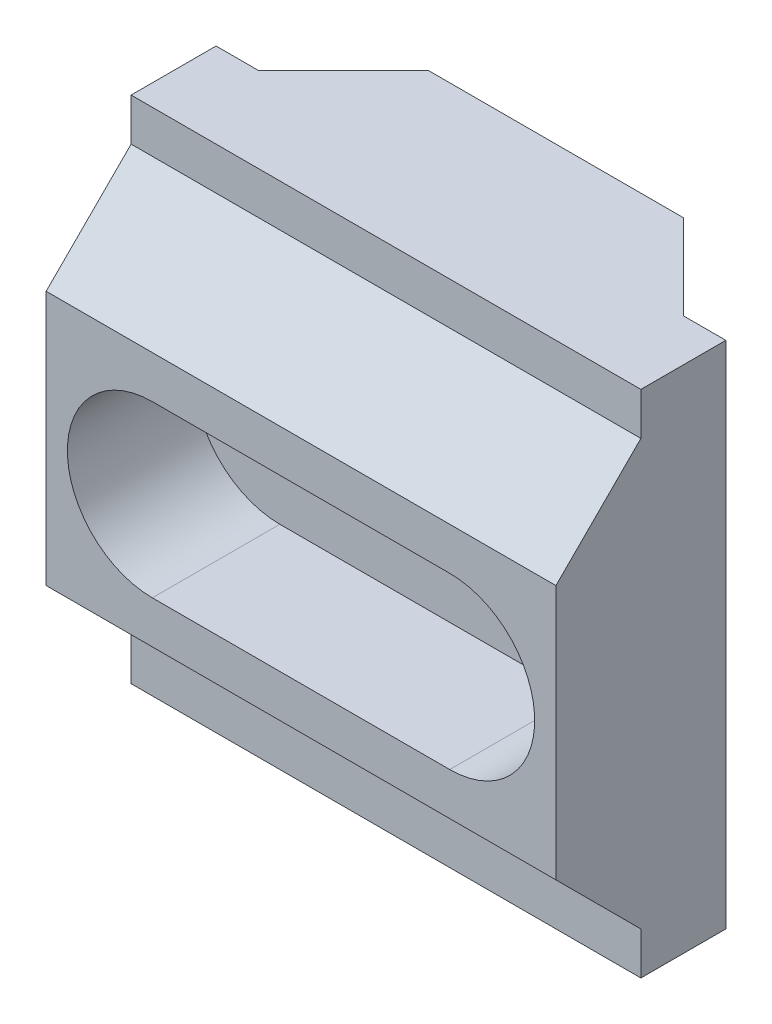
ISO-10303-21;
HEADER;
FILE_DESCRIPTION(('STEP AP214'),'2;1');
FILE_NAME('part.step','',(''),(''),'','','');
FILE_SCHEMA(('AUTOMOTIVE_DESIGN { 1 0 10303 214 1 1 1 1 }'));
ENDSEC;
DATA;
#1=APPLICATION_CONTEXT('core data for automotive mechanical design processes');
#2=APPLICATION_PROTOCOL_DEFINITION('international standard','automotive_design',2000,#1);
#3=PRODUCT_CONTEXT('',#1,'mechanical');
#4=PRODUCT('Part','Part','',(#3));
#5=PRODUCT_RELATED_PRODUCT_CATEGORY('part','',(#4));
#6=PRODUCT_DEFINITION_FORMATION('','',#4);
#7=PRODUCT_DEFINITION_CONTEXT('part definition',#1,'design');
#8=PRODUCT_DEFINITION('design','',#6,#7);
#9=PRODUCT_DEFINITION_SHAPE('','',#8);
#10=(LENGTH_UNIT() NAMED_UNIT(*) SI_UNIT(.MILLI.,.METRE.));
#11=(NAMED_UNIT(*) PLANE_ANGLE_UNIT() SI_UNIT($,.RADIAN.));
#12=(NAMED_UNIT(*) SI_UNIT($,.STERADIAN.) SOLID_ANGLE_UNIT());
#13=UNCERTAINTY_MEASURE_WITH_UNIT(LENGTH_MEASURE(1.E-05),#10,'distance_accuracy_value','');
#14=(GEOMETRIC_REPRESENTATION_CONTEXT(3) GLOBAL_UNCERTAINTY_ASSIGNED_CONTEXT((#13)) GLOBAL_UNIT_ASSIGNED_CONTEXT((#10,
#11,#12)) REPRESENTATION_CONTEXT('',''));
#15=CARTESIAN_POINT('',(0.,0.,0.));
#16=DIRECTION('',(0.,0.,1.));
#17=DIRECTION('',(1.,0.,0.));
#18=AXIS2_PLACEMENT_3D('',#15,#16,#17);
#19=CARTESIAN_POINT('',(0.,0.,-7.21911419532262E-13));
#20=DIRECTION('',(0.,0.,-1.));
#21=DIRECTION('',(-1.,0.,0.));
#22=AXIS2_PLACEMENT_3D('',#19,#20,#21);
#23=PLANE('',#22);
#24=DIRECTION('',(1.,0.,0.));
#25=VECTOR('',#24,1.);
#26=CARTESIAN_POINT('',(22.225,-12.7,-7.21911419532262E-13));
#27=LINE('',#26,#25);
#28=CARTESIAN_POINT('',(-22.225,-12.7,-7.21911419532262E-13));
#29=VERTEX_POINT('',#28);
#30=CARTESIAN_POINT('',(22.225,-12.7,-7.21911419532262E-13));
#31=VERTEX_POINT('',#30);
#32=EDGE_CURVE('E150',#29,#31,#27,.T.);
#33=ORIENTED_EDGE('',*,*,#32,.T.);
#34=CARTESIAN_POINT('',(22.225,0.,-7.21911419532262E-13));
#35=DIRECTION('',(0.,0.,1.));
#36=DIRECTION('',(1.,0.,0.));
#37=AXIS2_PLACEMENT_3D('',#34,#35,#36);
#38=CIRCLE('',#37,12.7);
#39=CARTESIAN_POINT('',(22.225,12.7,-7.21911419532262E-13));
#40=VERTEX_POINT('',#39);
#41=EDGE_CURVE('E19',#31,#40,#38,.T.);
#42=ORIENTED_EDGE('',*,*,#41,.T.);
#43=DIRECTION('',(1.,0.,0.));
#44=VECTOR('',#43,1.);
#45=CARTESIAN_POINT('',(-22.225,12.7,-7.21911419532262E-13));
#46=LINE('',#45,#44);
#47=CARTESIAN_POINT('',(-22.225,12.7,-7.21911419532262E-13));
#48=VERTEX_POINT('',#47);
#49=EDGE_CURVE('E153',#40,#48,#46,.F.);
#50=ORIENTED_EDGE('',*,*,#49,.T.);
#51=CARTESIAN_POINT('',(-22.225,0.,-7.21911419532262E-13));
#52=DIRECTION('',(0.,0.,1.));
#53=DIRECTION('',(1.,0.,0.));
#54=AXIS2_PLACEMENT_3D('',#51,#52,#53);
#55=CIRCLE('',#54,12.7);
#56=EDGE_CURVE('E208',#48,#29,#55,.T.);
#57=ORIENTED_EDGE('',*,*,#56,.T.);
#58=EDGE_LOOP('',(#33,#42,#50,#57));
#59=FACE_BOUND('',#58,.T.);
#60=ADVANCED_FACE('F16',(#59),#23,.F.);
#61=CARTESIAN_POINT('',(-22.225,12.7,-7.21911419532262E-13));
#62=DIRECTION('',(0.,1.,0.));
#63=DIRECTION('',(0.,0.,1.));
#64=AXIS2_PLACEMENT_3D('',#61,#62,#63);
#65=PLANE('',#64);
#66=DIRECTION('',(0.,0.,1.));
#67=VECTOR('',#66,1.);
#68=CARTESIAN_POINT('',(-22.225,12.7,-7.21911419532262E-13));
#69=LINE('',#68,#67);
#70=CARTESIAN_POINT('',(-22.225,12.7,19.05));
#71=VERTEX_POINT('',#70);
#72=EDGE_CURVE('E163',#71,#48,#69,.F.);
#73=ORIENTED_EDGE('',*,*,#72,.T.);
#74=ORIENTED_EDGE('',*,*,#49,.F.);
#75=DIRECTION('',(0.,0.,1.));
#76=VECTOR('',#75,1.);
#77=CARTESIAN_POINT('',(22.225,12.7,-7.21911419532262E-13));
#78=LINE('',#77,#76);
#79=CARTESIAN_POINT('',(22.225,12.7,19.05));
#80=VERTEX_POINT('',#79);
#81=EDGE_CURVE('E158',#40,#80,#78,.T.);
#82=ORIENTED_EDGE('',*,*,#81,.T.);
#83=DIRECTION('',(1.,0.,0.));
#84=VECTOR('',#83,1.);
#85=CARTESIAN_POINT('',(38.1,12.7,19.05));
#86=LINE('',#85,#84);
#87=EDGE_CURVE('E207',#71,#80,#86,.T.);
#88=ORIENTED_EDGE('',*,*,#87,.F.);
#89=EDGE_LOOP('',(#73,#74,#82,#88));
#90=FACE_BOUND('',#89,.T.);
#91=ADVANCED_FACE('F160',(#90),#65,.F.);
#92=CARTESIAN_POINT('',(22.225,0.,-7.21911419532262E-13));
#93=DIRECTION('',(0.,0.,1.));
#94=DIRECTION('',(1.,0.,0.));
#95=AXIS2_PLACEMENT_3D('',#92,#93,#94);
#96=CYLINDRICAL_SURFACE('',#95,12.7);
#97=ORIENTED_EDGE('',*,*,#81,.F.);
#98=ORIENTED_EDGE('',*,*,#41,.F.);
#99=DIRECTION('',(0.,0.,1.));
#100=VECTOR('',#99,1.);
#101=CARTESIAN_POINT('',(22.225,-12.7,-7.21911419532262E-13));
#102=LINE('',#101,#100);
#103=CARTESIAN_POINT('',(22.225,-12.7,19.05));
#104=VERTEX_POINT('',#103);
#105=EDGE_CURVE('E171',#31,#104,#102,.T.);
#106=ORIENTED_EDGE('',*,*,#105,.T.);
#107=CARTESIAN_POINT('',(22.225,0.,19.05));
#108=DIRECTION('',(0.,0.,1.));
#109=DIRECTION('',(1.,0.,0.));
#110=AXIS2_PLACEMENT_3D('',#107,#108,#109);
#111=CIRCLE('',#110,12.7);
#112=EDGE_CURVE('E168',#80,#104,#111,.F.);
#113=ORIENTED_EDGE('',*,*,#112,.F.);
#114=EDGE_LOOP('',(#97,#98,#106,#113));
#115=FACE_BOUND('',#114,.T.);
#116=ADVANCED_FACE('F166',(#115),#96,.F.);
#117=CARTESIAN_POINT('',(22.225,-12.7,-7.21911419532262E-13));
#118=DIRECTION('',(0.,-1.,0.));
#119=DIRECTION('',(1.,0.,0.));
#120=AXIS2_PLACEMENT_3D('',#117,#118,#119);
#121=PLANE('',#120);
#122=ORIENTED_EDGE('',*,*,#105,.F.);
#123=ORIENTED_EDGE('',*,*,#32,.F.);
#124=DIRECTION('',(0.,0.,1.));
#125=VECTOR('',#124,1.);
#126=CARTESIAN_POINT('',(-22.225,-12.7,-7.21911419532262E-13));
#127=LINE('',#126,#125);
#128=CARTESIAN_POINT('',(-22.225,-12.7,19.05));
#129=VERTEX_POINT('',#128);
#130=EDGE_CURVE('E209',#29,#129,#127,.T.);
#131=ORIENTED_EDGE('',*,*,#130,.T.);
#132=DIRECTION('',(1.,0.,0.));
#133=VECTOR('',#132,1.);
#134=CARTESIAN_POINT('',(38.1,-12.7,19.05));
#135=LINE('',#134,#133);
#136=EDGE_CURVE('E206',#104,#129,#135,.F.);
#137=ORIENTED_EDGE('',*,*,#136,.F.);
#138=EDGE_LOOP('',(#122,#123,#131,#137));
#139=FACE_BOUND('',#138,.T.);
#140=ADVANCED_FACE('F425',(#139),#121,.F.);
#141=CARTESIAN_POINT('',(-22.225,0.,-7.21911419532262E-13));
#142=DIRECTION('',(0.,0.,1.));
#143=DIRECTION('',(1.,0.,0.));
#144=AXIS2_PLACEMENT_3D('',#141,#142,#143);
#145=CYLINDRICAL_SURFACE('',#144,12.7);
#146=ORIENTED_EDGE('',*,*,#130,.F.);
#147=ORIENTED_EDGE('',*,*,#56,.F.);
#148=ORIENTED_EDGE('',*,*,#72,.F.);
#149=CARTESIAN_POINT('',(-22.225,0.,19.05));
#150=DIRECTION('',(0.,0.,1.));
#151=DIRECTION('',(1.,0.,0.));
#152=AXIS2_PLACEMENT_3D('',#149,#150,#151);
#153=CIRCLE('',#152,12.7);
#154=EDGE_CURVE('E202',#129,#71,#153,.F.);
#155=ORIENTED_EDGE('',*,*,#154,.F.);
#156=EDGE_LOOP('',(#146,#147,#148,#155));
#157=FACE_BOUND('',#156,.T.);
#158=ADVANCED_FACE('F417',(#157),#145,.F.);
#159=CARTESIAN_POINT('',(-17.4625,-25.4,-4.76250000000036));
#160=DIRECTION('',(0.,1.,0.));
#161=DIRECTION('',(0.,0.,1.));
#162=AXIS2_PLACEMENT_3D('',#159,#160,#161);
#163=PLANE('',#162);
#164=CARTESIAN_POINT('',(-17.4625,-25.4,-4.76250000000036));
#165=DIRECTION('',(0.,-1.,0.));
#166=DIRECTION('',(1.,0.,0.));
#167=AXIS2_PLACEMENT_3D('',#164,#165,#166);
#168=CIRCLE('',#167,2.5796875);
#169=CARTESIAN_POINT('',(-14.8828125,-25.4,-4.76250000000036));
#170=VERTEX_POINT('',#169);
#171=CARTESIAN_POINT('',(-20.0421875,-25.4,-4.76250000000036));
#172=VERTEX_POINT('',#171);
#173=EDGE_CURVE('E196',#170,#172,#168,.T.);
#174=ORIENTED_EDGE('',*,*,#173,.T.);
#175=CARTESIAN_POINT('',(-17.4625,-25.4,-4.76250000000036));
#176=DIRECTION('',(0.,-1.,0.));
#177=DIRECTION('',(1.,0.,0.));
#178=AXIS2_PLACEMENT_3D('',#175,#176,#177);
#179=CIRCLE('',#178,2.5796875);
#180=EDGE_CURVE('E199',#172,#170,#179,.T.);
#181=ORIENTED_EDGE('',*,*,#180,.T.);
#182=EDGE_LOOP('',(#174,#181));
#183=FACE_BOUND('',#182,.T.);
#184=ADVANCED_FACE('F414',(#183),#163,.F.);
#185=CARTESIAN_POINT('',(17.4625,-25.4,-4.76250000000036));
#186=DIRECTION('',(0.,1.,0.));
#187=DIRECTION('',(0.,0.,1.));
#188=AXIS2_PLACEMENT_3D('',#185,#186,#187);
#189=PLANE('',#188);
#190=CARTESIAN_POINT('',(17.4625,-25.4,-4.76250000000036));
#191=DIRECTION('',(0.,-1.,0.));
#192=DIRECTION('',(1.,0.,0.));
#193=AXIS2_PLACEMENT_3D('',#190,#191,#192);
#194=CIRCLE('',#193,2.5796875);
#195=CARTESIAN_POINT('',(20.0421875,-25.4,-4.76250000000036));
#196=VERTEX_POINT('',#195);
#197=CARTESIAN_POINT('',(14.8828125,-25.4,-4.76250000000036));
#198=VERTEX_POINT('',#197);
#199=EDGE_CURVE('E190',#196,#198,#194,.T.);
#200=ORIENTED_EDGE('',*,*,#199,.T.);
#201=CARTESIAN_POINT('',(17.4625,-25.4,-4.76250000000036));
#202=DIRECTION('',(0.,-1.,0.));
#203=DIRECTION('',(1.,0.,0.));
#204=AXIS2_PLACEMENT_3D('',#201,#202,#203);
#205=CIRCLE('',#204,2.5796875);
#206=EDGE_CURVE('E193',#198,#196,#205,.T.);
#207=ORIENTED_EDGE('',*,*,#206,.T.);
#208=EDGE_LOOP('',(#200,#207));
#209=FACE_BOUND('',#208,.T.);
#210=ADVANCED_FACE('F416',(#209),#189,.F.);
#211=CARTESIAN_POINT('',(38.1,-19.05,19.05));
#212=DIRECTION('',(0.,-0.707106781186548,0.707106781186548));
#213=DIRECTION('',(0.,-0.707106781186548,-0.707106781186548));
#214=AXIS2_PLACEMENT_3D('',#211,#212,#213);
#215=PLANE('',#214);
#216=DIRECTION('',(0.,0.707106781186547,0.707106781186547));
#217=VECTOR('',#216,1.);
#218=CARTESIAN_POINT('',(38.1,-31.75,6.35));
#219=LINE('',#218,#217);
#220=CARTESIAN_POINT('',(38.1,-31.75,6.35000000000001));
#221=VERTEX_POINT('',#220);
#222=CARTESIAN_POINT('',(38.1,-19.05,19.05));
#223=VERTEX_POINT('',#222);
#224=EDGE_CURVE('E231',#221,#223,#219,.T.);
#225=ORIENTED_EDGE('',*,*,#224,.T.);
#226=DIRECTION('',(1.,0.,0.));
#227=VECTOR('',#226,1.);
#228=CARTESIAN_POINT('',(38.1,-19.05,19.05));
#229=LINE('',#228,#227);
#230=CARTESIAN_POINT('',(-38.1,-19.05,19.05));
#231=VERTEX_POINT('',#230);
#232=EDGE_CURVE('E205',#231,#223,#229,.T.);
#233=ORIENTED_EDGE('',*,*,#232,.F.);
#234=DIRECTION('',(0.,0.707106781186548,0.707106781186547));
#235=VECTOR('',#234,1.);
#236=CARTESIAN_POINT('',(-38.1,-31.75,6.35));
#237=LINE('',#236,#235);
#238=CARTESIAN_POINT('',(-38.1,-31.75,6.35000000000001));
#239=VERTEX_POINT('',#238);
#240=EDGE_CURVE('E249',#239,#231,#237,.T.);
#241=ORIENTED_EDGE('',*,*,#240,.F.);
#242=DIRECTION('',(1.,0.,0.));
#243=VECTOR('',#242,1.);
#244=CARTESIAN_POINT('',(38.1,-31.75,6.35));
#245=LINE('',#244,#243);
#246=EDGE_CURVE('E225',#221,#239,#245,.F.);
#247=ORIENTED_EDGE('',*,*,#246,.F.);
#248=EDGE_LOOP('',(#225,#233,#241,#247));
#249=FACE_BOUND('',#248,.T.);
#250=ADVANCED_FACE('F351',(#249),#215,.T.);
#251=CARTESIAN_POINT('',(38.1,19.05,19.05));
#252=DIRECTION('',(0.,0.,1.));
#253=DIRECTION('',(1.,0.,0.));
#254=AXIS2_PLACEMENT_3D('',#251,#252,#253);
#255=PLANE('',#254);
#256=DIRECTION('',(0.,-1.,0.));
#257=VECTOR('',#256,1.);
#258=CARTESIAN_POINT('',(38.1,0.,19.05));
#259=LINE('',#258,#257);
#260=CARTESIAN_POINT('',(38.1,19.05,19.05));
#261=VERTEX_POINT('',#260);
#262=EDGE_CURVE('E233',#223,#261,#259,.F.);
#263=ORIENTED_EDGE('',*,*,#262,.T.);
#264=DIRECTION('',(1.,0.,0.));
#265=VECTOR('',#264,1.);
#266=CARTESIAN_POINT('',(38.1,19.05,19.05));
#267=LINE('',#266,#265);
#268=CARTESIAN_POINT('',(-38.1,19.05,19.05));
#269=VERTEX_POINT('',#268);
#270=EDGE_CURVE('E201',#269,#261,#267,.T.);
#271=ORIENTED_EDGE('',*,*,#270,.F.);
#272=DIRECTION('',(0.,-1.,0.));
#273=VECTOR('',#272,1.);
#274=CARTESIAN_POINT('',(-38.1,38.1,19.05));
#275=LINE('',#274,#273);
#276=EDGE_CURVE('E252',#231,#269,#275,.F.);
#277=ORIENTED_EDGE('',*,*,#276,.F.);
#278=ORIENTED_EDGE('',*,*,#232,.T.);
#279=EDGE_LOOP('',(#263,#271,#277,#278));
#280=FACE_BOUND('',#279,.T.);
#281=ORIENTED_EDGE('',*,*,#136,.T.);
#282=ORIENTED_EDGE('',*,*,#154,.T.);
#283=ORIENTED_EDGE('',*,*,#87,.T.);
#284=ORIENTED_EDGE('',*,*,#112,.T.);
#285=EDGE_LOOP('',(#281,#282,#283,#284));
#286=FACE_BOUND('',#285,.T.);
#287=ADVANCED_FACE('F353',(#280,#286),#255,.T.);
#288=CARTESIAN_POINT('',(38.1,31.75,6.35));
#289=DIRECTION('',(0.,0.707106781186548,0.707106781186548));
#290=DIRECTION('',(0.,-0.707106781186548,0.707106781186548));
#291=AXIS2_PLACEMENT_3D('',#288,#289,#290);
#292=PLANE('',#291);
#293=DIRECTION('',(0.,0.707106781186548,-0.707106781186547));
#294=VECTOR('',#293,1.);
#295=CARTESIAN_POINT('',(38.1,19.05,19.05));
#296=LINE('',#295,#294);
#297=CARTESIAN_POINT('',(38.1,31.75,6.35));
#298=VERTEX_POINT('',#297);
#299=EDGE_CURVE('E235',#261,#298,#296,.T.);
#300=ORIENTED_EDGE('',*,*,#299,.T.);
#301=DIRECTION('',(1.,0.,0.));
#302=VECTOR('',#301,1.);
#303=CARTESIAN_POINT('',(38.1,31.75,6.35));
#304=LINE('',#303,#302);
#305=CARTESIAN_POINT('',(-38.1,31.75,6.35000000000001));
#306=VERTEX_POINT('',#305);
#307=EDGE_CURVE('E237',#306,#298,#304,.T.);
#308=ORIENTED_EDGE('',*,*,#307,.F.);
#309=DIRECTION('',(0.,0.707106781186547,-0.707106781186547));
#310=VECTOR('',#309,1.);
#311=CARTESIAN_POINT('',(-38.1,19.05,19.05));
#312=LINE('',#311,#310);
#313=EDGE_CURVE('E255',#269,#306,#312,.T.);
#314=ORIENTED_EDGE('',*,*,#313,.F.);
#315=ORIENTED_EDGE('',*,*,#270,.T.);
#316=EDGE_LOOP('',(#300,#308,#314,#315));
#317=FACE_BOUND('',#316,.T.);
#318=ADVANCED_FACE('F357',(#317),#292,.T.);
#319=CARTESIAN_POINT('',(-17.4625,-31.75,-4.76250000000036));
#320=DIRECTION('',(0.,-1.,0.));
#321=DIRECTION('',(1.,0.,0.));
#322=AXIS2_PLACEMENT_3D('',#319,#320,#321);
#323=CYLINDRICAL_SURFACE('',#322,2.5796875);
#324=ORIENTED_EDGE('',*,*,#180,.F.);
#325=DIRECTION('',(0.,-1.,0.));
#326=VECTOR('',#325,1.);
#327=CARTESIAN_POINT('',(-20.0421875,-31.75,-4.76250000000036));
#328=LINE('',#327,#326);
#329=CARTESIAN_POINT('',(-20.0421875,-38.1,-4.76250000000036));
#330=VERTEX_POINT('',#329);
#331=EDGE_CURVE('E198',#172,#330,#328,.T.);
#332=ORIENTED_EDGE('',*,*,#331,.T.);
#333=CARTESIAN_POINT('',(-17.4625,-38.1,-4.76250000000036));
#334=DIRECTION('',(0.,-1.,0.));
#335=DIRECTION('',(1.,0.,0.));
#336=AXIS2_PLACEMENT_3D('',#333,#334,#335);
#337=CIRCLE('',#336,2.5796875);
#338=CARTESIAN_POINT('',(-14.8828125,-38.1,-4.76250000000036));
#339=VERTEX_POINT('',#338);
#340=EDGE_CURVE('E186',#339,#330,#337,.F.);
#341=ORIENTED_EDGE('',*,*,#340,.F.);
#342=DIRECTION('',(0.,-1.,0.));
#343=VECTOR('',#342,1.);
#344=CARTESIAN_POINT('',(-14.8828125,-31.75,-4.76250000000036));
#345=LINE('',#344,#343);
#346=EDGE_CURVE('E195',#339,#170,#345,.F.);
#347=ORIENTED_EDGE('',*,*,#346,.T.);
#348=EDGE_LOOP('',(#324,#332,#341,#347));
#349=FACE_BOUND('',#348,.T.);
#350=ADVANCED_FACE('F359',(#349),#323,.F.);
#351=CARTESIAN_POINT('',(-17.4625,-31.75,-4.76250000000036));
#352=DIRECTION('',(0.,-1.,0.));
#353=DIRECTION('',(1.,0.,0.));
#354=AXIS2_PLACEMENT_3D('',#351,#352,#353);
#355=CYLINDRICAL_SURFACE('',#354,2.5796875);
#356=CARTESIAN_POINT('',(-17.4625,-38.1,-4.76250000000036));
#357=DIRECTION('',(0.,-1.,0.));
#358=DIRECTION('',(1.,0.,0.));
#359=AXIS2_PLACEMENT_3D('',#356,#357,#358);
#360=CIRCLE('',#359,2.5796875);
#361=EDGE_CURVE('E183',#330,#339,#360,.F.);
#362=ORIENTED_EDGE('',*,*,#361,.F.);
#363=ORIENTED_EDGE('',*,*,#331,.F.);
#364=ORIENTED_EDGE('',*,*,#173,.F.);
#365=ORIENTED_EDGE('',*,*,#346,.F.);
#366=EDGE_LOOP('',(#362,#363,#364,#365));
#367=FACE_BOUND('',#366,.T.);
#368=ADVANCED_FACE('F366',(#367),#355,.F.);
#369=CARTESIAN_POINT('',(17.4625,-31.75,-4.76250000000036));
#370=DIRECTION('',(0.,-1.,0.));
#371=DIRECTION('',(1.,0.,0.));
#372=AXIS2_PLACEMENT_3D('',#369,#370,#371);
#373=CYLINDRICAL_SURFACE('',#372,2.5796875);
#374=ORIENTED_EDGE('',*,*,#206,.F.);
#375=DIRECTION('',(0.,-1.,0.));
#376=VECTOR('',#375,1.);
#377=CARTESIAN_POINT('',(14.8828125,-31.75,-4.76250000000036));
#378=LINE('',#377,#376);
#379=CARTESIAN_POINT('',(14.8828125,-38.1,-4.76250000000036));
#380=VERTEX_POINT('',#379);
#381=EDGE_CURVE('E192',#198,#380,#378,.T.);
#382=ORIENTED_EDGE('',*,*,#381,.T.);
#383=CARTESIAN_POINT('',(17.4625,-38.1,-4.76250000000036));
#384=DIRECTION('',(0.,-1.,0.));
#385=DIRECTION('',(1.,0.,0.));
#386=AXIS2_PLACEMENT_3D('',#383,#384,#385);
#387=CIRCLE('',#386,2.5796875);
#388=CARTESIAN_POINT('',(20.0421875,-38.1,-4.76250000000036));
#389=VERTEX_POINT('',#388);
#390=EDGE_CURVE('E180',#389,#380,#387,.F.);
#391=ORIENTED_EDGE('',*,*,#390,.F.);
#392=DIRECTION('',(0.,-1.,0.));
#393=VECTOR('',#392,1.);
#394=CARTESIAN_POINT('',(20.0421875,-31.75,-4.76250000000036));
#395=LINE('',#394,#393);
#396=EDGE_CURVE('E222',#389,#196,#395,.F.);
#397=ORIENTED_EDGE('',*,*,#396,.T.);
#398=EDGE_LOOP('',(#374,#382,#391,#397));
#399=FACE_BOUND('',#398,.T.);
#400=ADVANCED_FACE('F398',(#399),#373,.F.);
#401=CARTESIAN_POINT('',(17.4625,-31.75,-4.76250000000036));
#402=DIRECTION('',(0.,-1.,0.));
#403=DIRECTION('',(1.,0.,0.));
#404=AXIS2_PLACEMENT_3D('',#401,#402,#403);
#405=CYLINDRICAL_SURFACE('',#404,2.5796875);
#406=CARTESIAN_POINT('',(17.4625,-38.1,-4.76250000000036));
#407=DIRECTION('',(0.,-1.,0.));
#408=DIRECTION('',(1.,0.,0.));
#409=AXIS2_PLACEMENT_3D('',#406,#407,#408);
#410=CIRCLE('',#409,2.5796875);
#411=EDGE_CURVE('E176',#380,#389,#410,.F.);
#412=ORIENTED_EDGE('',*,*,#411,.F.);
#413=ORIENTED_EDGE('',*,*,#381,.F.);
#414=ORIENTED_EDGE('',*,*,#199,.F.);
#415=ORIENTED_EDGE('',*,*,#396,.F.);
#416=EDGE_LOOP('',(#412,#413,#414,#415));
#417=FACE_BOUND('',#416,.T.);
#418=ADVANCED_FACE('F395',(#417),#405,.F.);
#419=CARTESIAN_POINT('',(38.1,-31.75,6.35));
#420=DIRECTION('',(0.,0.,1.));
#421=DIRECTION('',(1.,0.,0.));
#422=AXIS2_PLACEMENT_3D('',#419,#420,#421);
#423=PLANE('',#422);
#424=DIRECTION('',(0.,-1.,0.));
#425=VECTOR('',#424,1.);
#426=CARTESIAN_POINT('',(38.1,0.,6.35));
#427=LINE('',#426,#425);
#428=CARTESIAN_POINT('',(38.1,-38.1,6.35));
#429=VERTEX_POINT('',#428);
#430=EDGE_CURVE('E228',#429,#221,#427,.F.);
#431=ORIENTED_EDGE('',*,*,#430,.T.);
#432=ORIENTED_EDGE('',*,*,#246,.T.);
#433=DIRECTION('',(0.,-1.,0.));
#434=VECTOR('',#433,1.);
#435=CARTESIAN_POINT('',(-38.1,38.1,6.35));
#436=LINE('',#435,#434);
#437=CARTESIAN_POINT('',(-38.1,-38.1,6.35));
#438=VERTEX_POINT('',#437);
#439=EDGE_CURVE('E246',#438,#239,#436,.F.);
#440=ORIENTED_EDGE('',*,*,#439,.F.);
#441=DIRECTION('',(1.,0.,0.));
#442=VECTOR('',#441,1.);
#443=CARTESIAN_POINT('',(31.75,-38.1,6.35));
#444=LINE('',#443,#442);
#445=EDGE_CURVE('E267',#429,#438,#444,.F.);
#446=ORIENTED_EDGE('',*,*,#445,.F.);
#447=EDGE_LOOP('',(#431,#432,#440,#446));
#448=FACE_BOUND('',#447,.T.);
#449=ADVANCED_FACE('F346',(#448),#423,.T.);
#450=CARTESIAN_POINT('',(38.1,0.,6.35));
#451=DIRECTION('',(-1.,0.,0.));
#452=DIRECTION('',(0.,-1.,0.));
#453=AXIS2_PLACEMENT_3D('',#450,#451,#452);
#454=PLANE('',#453);
#455=DIRECTION('',(0.,1.,0.));
#456=VECTOR('',#455,1.);
#457=CARTESIAN_POINT('',(38.1,38.1,6.35));
#458=LINE('',#457,#456);
#459=CARTESIAN_POINT('',(38.1,38.0999999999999,6.35));
#460=VERTEX_POINT('',#459);
#461=EDGE_CURVE('E240',#298,#460,#458,.T.);
#462=ORIENTED_EDGE('',*,*,#461,.F.);
#463=ORIENTED_EDGE('',*,*,#299,.F.);
#464=ORIENTED_EDGE('',*,*,#262,.F.);
#465=ORIENTED_EDGE('',*,*,#224,.F.);
#466=ORIENTED_EDGE('',*,*,#430,.F.);
#467=DIRECTION('',(0.,0.,1.));
#468=VECTOR('',#467,1.);
#469=CARTESIAN_POINT('',(38.1,-38.1,-6.35));
#470=LINE('',#469,#468);
#471=CARTESIAN_POINT('',(38.1,-38.1,-6.35));
#472=VERTEX_POINT('',#471);
#473=EDGE_CURVE('E264',#472,#429,#470,.T.);
#474=ORIENTED_EDGE('',*,*,#473,.F.);
#475=DIRECTION('',(0.,1.,0.));
#476=VECTOR('',#475,1.);
#477=CARTESIAN_POINT('',(38.1,-38.1,-6.35));
#478=LINE('',#477,#476);
#479=CARTESIAN_POINT('',(38.1,38.0999999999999,-6.35));
#480=VERTEX_POINT('',#479);
#481=EDGE_CURVE('E189',#480,#472,#478,.F.);
#482=ORIENTED_EDGE('',*,*,#481,.F.);
#483=DIRECTION('',(0.,0.,1.));
#484=VECTOR('',#483,1.);
#485=CARTESIAN_POINT('',(38.1,38.0999999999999,-12.7));
#486=LINE('',#485,#484);
#487=EDGE_CURVE('E284',#480,#460,#486,.T.);
#488=ORIENTED_EDGE('',*,*,#487,.T.);
#489=EDGE_LOOP('',(#462,#463,#464,#465,#466,#474,#482,#488));
#490=FACE_BOUND('',#489,.T.);
#491=ADVANCED_FACE('F332',(#490),#454,.F.);
#492=CARTESIAN_POINT('',(38.1,38.1,6.35));
#493=DIRECTION('',(0.,0.,1.));
#494=DIRECTION('',(1.,0.,0.));
#495=AXIS2_PLACEMENT_3D('',#492,#493,#494);
#496=PLANE('',#495);
#497=ORIENTED_EDGE('',*,*,#461,.T.);
#498=DIRECTION('',(1.,0.,0.));
#499=VECTOR('',#498,1.);
#500=CARTESIAN_POINT('',(0.,38.1,6.35));
#501=LINE('',#500,#499);
#502=CARTESIAN_POINT('',(-38.1,38.1,6.35));
#503=VERTEX_POINT('',#502);
#504=EDGE_CURVE('E286',#460,#503,#501,.F.);
#505=ORIENTED_EDGE('',*,*,#504,.T.);
#506=DIRECTION('',(0.,-1.,0.));
#507=VECTOR('',#506,1.);
#508=CARTESIAN_POINT('',(-38.1,38.1,6.35));
#509=LINE('',#508,#507);
#510=EDGE_CURVE('E243',#306,#503,#509,.F.);
#511=ORIENTED_EDGE('',*,*,#510,.F.);
#512=ORIENTED_EDGE('',*,*,#307,.T.);
#513=EDGE_LOOP('',(#497,#505,#511,#512));
#514=FACE_BOUND('',#513,.T.);
#515=ADVANCED_FACE('F328',(#514),#496,.T.);
#516=CARTESIAN_POINT('',(-38.1,38.1,6.35));
#517=DIRECTION('',(-1.,0.,0.));
#518=DIRECTION('',(0.,-1.,0.));
#519=AXIS2_PLACEMENT_3D('',#516,#517,#518);
#520=PLANE('',#519);
#521=ORIENTED_EDGE('',*,*,#276,.T.);
#522=ORIENTED_EDGE('',*,*,#313,.T.);
#523=ORIENTED_EDGE('',*,*,#510,.T.);
#524=DIRECTION('',(0.,0.,1.));
#525=VECTOR('',#524,1.);
#526=CARTESIAN_POINT('',(-38.1,38.1,-12.7));
#527=LINE('',#526,#525);
#528=CARTESIAN_POINT('',(-38.1,38.1,-6.35));
#529=VERTEX_POINT('',#528);
#530=EDGE_CURVE('E288',#503,#529,#527,.F.);
#531=ORIENTED_EDGE('',*,*,#530,.T.);
#532=DIRECTION('',(0.,1.,0.));
#533=VECTOR('',#532,1.);
#534=CARTESIAN_POINT('',(-38.1,-38.1,-6.35));
#535=LINE('',#534,#533);
#536=CARTESIAN_POINT('',(-38.1,-38.1,-6.35));
#537=VERTEX_POINT('',#536);
#538=EDGE_CURVE('E258',#537,#529,#535,.T.);
#539=ORIENTED_EDGE('',*,*,#538,.F.);
#540=DIRECTION('',(0.,0.,1.));
#541=VECTOR('',#540,1.);
#542=CARTESIAN_POINT('',(-38.1,-38.1,-6.35));
#543=LINE('',#542,#541);
#544=EDGE_CURVE('E270',#438,#537,#543,.F.);
#545=ORIENTED_EDGE('',*,*,#544,.F.);
#546=ORIENTED_EDGE('',*,*,#439,.T.);
#547=ORIENTED_EDGE('',*,*,#240,.T.);
#548=EDGE_LOOP('',(#521,#522,#523,#531,#539,#545,#546,#547));
#549=FACE_BOUND('',#548,.T.);
#550=ADVANCED_FACE('F323',(#549),#520,.T.);
#551=CARTESIAN_POINT('',(38.1,-38.1,-6.35));
#552=DIRECTION('',(0.,0.,-1.));
#553=DIRECTION('',(-1.,0.,0.));
#554=AXIS2_PLACEMENT_3D('',#551,#552,#553);
#555=PLANE('',#554);
#556=ORIENTED_EDGE('',*,*,#538,.T.);
#557=DIRECTION('',(1.,0.,0.));
#558=VECTOR('',#557,1.);
#559=CARTESIAN_POINT('',(0.,38.1,-6.35));
#560=LINE('',#559,#558);
#561=CARTESIAN_POINT('',(-31.75,38.1,-6.35));
#562=VERTEX_POINT('',#561);
#563=EDGE_CURVE('E290',#529,#562,#560,.T.);
#564=ORIENTED_EDGE('',*,*,#563,.T.);
#565=DIRECTION('',(0.,1.,0.));
#566=VECTOR('',#565,1.);
#567=CARTESIAN_POINT('',(-31.75,38.1,-6.35));
#568=LINE('',#567,#566);
#569=CARTESIAN_POINT('',(-31.75,-38.1,-6.35));
#570=VERTEX_POINT('',#569);
#571=EDGE_CURVE('E278',#570,#562,#568,.T.);
#572=ORIENTED_EDGE('',*,*,#571,.F.);
#573=DIRECTION('',(1.,0.,0.));
#574=VECTOR('',#573,1.);
#575=CARTESIAN_POINT('',(31.75,-38.1,-6.35));
#576=LINE('',#575,#574);
#577=EDGE_CURVE('E273',#537,#570,#576,.T.);
#578=ORIENTED_EDGE('',*,*,#577,.F.);
#579=EDGE_LOOP('',(#556,#564,#572,#578));
#580=FACE_BOUND('',#579,.T.);
#581=ADVANCED_FACE('F320',(#580),#555,.T.);
#582=CARTESIAN_POINT('',(38.1,-38.1,-6.35));
#583=DIRECTION('',(0.,0.,-1.));
#584=DIRECTION('',(-1.,0.,0.));
#585=AXIS2_PLACEMENT_3D('',#582,#583,#584);
#586=PLANE('',#585);
#587=ORIENTED_EDGE('',*,*,#481,.T.);
#588=DIRECTION('',(1.,0.,0.));
#589=VECTOR('',#588,1.);
#590=CARTESIAN_POINT('',(31.75,-38.1,-6.35));
#591=LINE('',#590,#589);
#592=CARTESIAN_POINT('',(31.75,-38.1000000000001,-6.34999999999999));
#593=VERTEX_POINT('',#592);
#594=EDGE_CURVE('E179',#593,#472,#591,.T.);
#595=ORIENTED_EDGE('',*,*,#594,.F.);
#596=DIRECTION('',(0.,1.,0.));
#597=VECTOR('',#596,1.);
#598=CARTESIAN_POINT('',(31.75,38.1,-6.35));
#599=LINE('',#598,#597);
#600=CARTESIAN_POINT('',(31.75,38.0999999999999,-6.35));
#601=VERTEX_POINT('',#600);
#602=EDGE_CURVE('E298',#601,#593,#599,.F.);
#603=ORIENTED_EDGE('',*,*,#602,.F.);
#604=DIRECTION('',(1.,0.,0.));
#605=VECTOR('',#604,1.);
#606=CARTESIAN_POINT('',(0.,38.1,-6.35));
#607=LINE('',#606,#605);
#608=EDGE_CURVE('E281',#601,#480,#607,.T.);
#609=ORIENTED_EDGE('',*,*,#608,.T.);
#610=EDGE_LOOP('',(#587,#595,#603,#609));
#611=FACE_BOUND('',#610,.T.);
#612=ADVANCED_FACE('F337',(#611),#586,.T.);
#613=CARTESIAN_POINT('',(31.75,-38.1,-6.35));
#614=DIRECTION('',(0.,-1.,0.));
#615=DIRECTION('',(1.,0.,0.));
#616=AXIS2_PLACEMENT_3D('',#613,#614,#615);
#617=PLANE('',#616);
#618=DIRECTION('',(-0.707106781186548,0.,0.707106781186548));
#619=VECTOR('',#618,1.);
#620=CARTESIAN_POINT('',(-19.05,-38.1000000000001,-19.05));
#621=LINE('',#620,#619);
#622=CARTESIAN_POINT('',(-19.05,-38.1,-19.05));
#623=VERTEX_POINT('',#622);
#624=EDGE_CURVE('E275',#623,#570,#621,.T.);
#625=ORIENTED_EDGE('',*,*,#624,.F.);
#626=DIRECTION('',(-1.,0.,0.));
#627=VECTOR('',#626,1.);
#628=CARTESIAN_POINT('',(19.05,-38.1,-19.05));
#629=LINE('',#628,#627);
#630=CARTESIAN_POINT('',(19.05,-38.1000000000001,-19.05));
#631=VERTEX_POINT('',#630);
#632=EDGE_CURVE('E301',#631,#623,#629,.T.);
#633=ORIENTED_EDGE('',*,*,#632,.F.);
#634=DIRECTION('',(-0.707106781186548,0.,-0.707106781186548));
#635=VECTOR('',#634,1.);
#636=CARTESIAN_POINT('',(31.75,-38.1000000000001,-6.34999999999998));
#637=LINE('',#636,#635);
#638=EDGE_CURVE('E294',#593,#631,#637,.T.);
#639=ORIENTED_EDGE('',*,*,#638,.F.);
#640=ORIENTED_EDGE('',*,*,#594,.T.);
#641=ORIENTED_EDGE('',*,*,#473,.T.);
#642=ORIENTED_EDGE('',*,*,#445,.T.);
#643=ORIENTED_EDGE('',*,*,#544,.T.);
#644=ORIENTED_EDGE('',*,*,#577,.T.);
#645=EDGE_LOOP('',(#625,#633,#639,#640,#641,#642,#643,#644));
#646=FACE_BOUND('',#645,.T.);
#647=ORIENTED_EDGE('',*,*,#390,.T.);
#648=ORIENTED_EDGE('',*,*,#411,.T.);
#649=EDGE_LOOP('',(#647,#648));
#650=FACE_BOUND('',#649,.T.);
#651=ORIENTED_EDGE('',*,*,#340,.T.);
#652=ORIENTED_EDGE('',*,*,#361,.T.);
#653=EDGE_LOOP('',(#651,#652));
#654=FACE_BOUND('',#653,.T.);
#655=ADVANCED_FACE('F342',(#646,#650,#654),#617,.T.);
#656=CARTESIAN_POINT('',(-19.05,38.1,-19.05));
#657=DIRECTION('',(-0.707106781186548,0.,-0.707106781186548));
#658=DIRECTION('',(-0.707106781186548,0.,0.707106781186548));
#659=AXIS2_PLACEMENT_3D('',#656,#657,#658);
#660=PLANE('',#659);
#661=DIRECTION('',(0.707106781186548,0.,-0.707106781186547));
#662=VECTOR('',#661,1.);
#663=CARTESIAN_POINT('',(-31.75,38.1,-6.35));
#664=LINE('',#663,#662);
#665=CARTESIAN_POINT('',(-19.05,38.1,-19.05));
#666=VERTEX_POINT('',#665);
#667=EDGE_CURVE('E292',#562,#666,#664,.T.);
#668=ORIENTED_EDGE('',*,*,#667,.T.);
#669=DIRECTION('',(0.,1.,0.));
#670=VECTOR('',#669,1.);
#671=CARTESIAN_POINT('',(-19.05,38.1,-19.05));
#672=LINE('',#671,#670);
#673=EDGE_CURVE('E304',#623,#666,#672,.T.);
#674=ORIENTED_EDGE('',*,*,#673,.F.);
#675=ORIENTED_EDGE('',*,*,#624,.T.);
#676=ORIENTED_EDGE('',*,*,#571,.T.);
#677=EDGE_LOOP('',(#668,#674,#675,#676));
#678=FACE_BOUND('',#677,.T.);
#679=ADVANCED_FACE('F316',(#678),#660,.T.);
#680=CARTESIAN_POINT('',(0.,38.1,-12.7));
#681=DIRECTION('',(0.,-1.,0.));
#682=DIRECTION('',(1.,0.,0.));
#683=AXIS2_PLACEMENT_3D('',#680,#681,#682);
#684=PLANE('',#683);
#685=DIRECTION('',(-1.,0.,0.));
#686=VECTOR('',#685,1.);
#687=CARTESIAN_POINT('',(19.05,38.1,-19.05));
#688=LINE('',#687,#686);
#689=CARTESIAN_POINT('',(19.05,38.1,-19.05));
#690=VERTEX_POINT('',#689);
#691=EDGE_CURVE('E25',#666,#690,#688,.F.);
#692=ORIENTED_EDGE('',*,*,#691,.F.);
#693=ORIENTED_EDGE('',*,*,#667,.F.);
#694=ORIENTED_EDGE('',*,*,#563,.F.);
#695=ORIENTED_EDGE('',*,*,#530,.F.);
#696=ORIENTED_EDGE('',*,*,#504,.F.);
#697=ORIENTED_EDGE('',*,*,#487,.F.);
#698=ORIENTED_EDGE('',*,*,#608,.F.);
#699=DIRECTION('',(-0.707106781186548,0.,-0.707106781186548));
#700=VECTOR('',#699,1.);
#701=CARTESIAN_POINT('',(31.75,38.1,-6.35));
#702=LINE('',#701,#700);
#703=EDGE_CURVE('E34',#690,#601,#702,.F.);
#704=ORIENTED_EDGE('',*,*,#703,.F.);
#705=EDGE_LOOP('',(#692,#693,#694,#695,#696,#697,#698,#704));
#706=FACE_BOUND('',#705,.T.);
#707=ADVANCED_FACE('F312',(#706),#684,.F.);
#708=CARTESIAN_POINT('',(31.75,38.1,-6.35));
#709=DIRECTION('',(0.707106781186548,0.,-0.707106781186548));
#710=DIRECTION('',(-0.707106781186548,0.,-0.707106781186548));
#711=AXIS2_PLACEMENT_3D('',#708,#709,#710);
#712=PLANE('',#711);
#713=ORIENTED_EDGE('',*,*,#703,.T.);
#714=ORIENTED_EDGE('',*,*,#602,.T.);
#715=ORIENTED_EDGE('',*,*,#638,.T.);
#716=DIRECTION('',(0.,1.,0.));
#717=VECTOR('',#716,1.);
#718=CARTESIAN_POINT('',(19.05,38.1,-19.05));
#719=LINE('',#718,#717);
#720=EDGE_CURVE('E11',#690,#631,#719,.F.);
#721=ORIENTED_EDGE('',*,*,#720,.F.);
#722=EDGE_LOOP('',(#713,#714,#715,#721));
#723=FACE_BOUND('',#722,.T.);
#724=ADVANCED_FACE('F340',(#723),#712,.T.);
#725=CARTESIAN_POINT('',(19.05,38.1,-19.05));
#726=DIRECTION('',(0.,0.,-1.));
#727=DIRECTION('',(-1.,0.,0.));
#728=AXIS2_PLACEMENT_3D('',#725,#726,#727);
#729=PLANE('',#728);
#730=ORIENTED_EDGE('',*,*,#691,.T.);
#731=ORIENTED_EDGE('',*,*,#720,.T.);
#732=ORIENTED_EDGE('',*,*,#632,.T.);
#733=ORIENTED_EDGE('',*,*,#673,.T.);
#734=EDGE_LOOP('',(#730,#731,#732,#733));
#735=FACE_BOUND('',#734,.T.);
#736=ADVANCED_FACE('F309',(#735),#729,.T.);
#737=CLOSED_SHELL('',(#60,#91,#116,#140,#158,#184,#210,#250,#287,#318,#350,#368,#400,#418,#449,
#491,#515,#550,#581,#612,#655,#679,#707,#724,#736));
#738=MANIFOLD_SOLID_BREP('B1',#737);
#739=ADVANCED_BREP_SHAPE_REPRESENTATION('',(#18,#738),#14);
#740=SHAPE_DEFINITION_REPRESENTATION(#9,#739);
ENDSEC;
END-ISO-10303-21;
